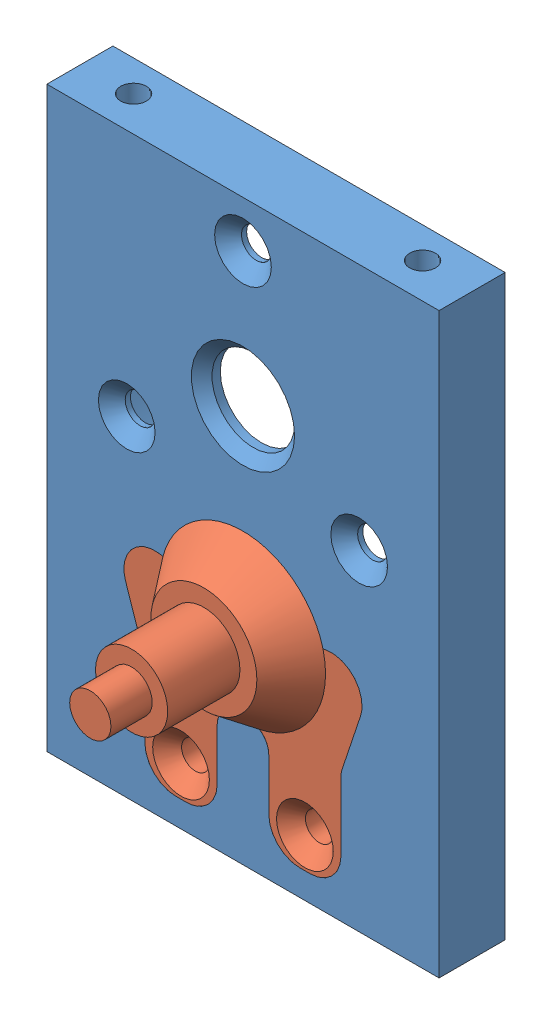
SolidWorks assembly montagem suporte motor.SLDASM, configuration Valor predeterminado (file format 11000). Lengths in mm.
Overall size (38 56 21.19).
2 component instances, 2 part files, 3 mates.
Components (placement in the parent):
- NOVO SUPORTE-1: NOVO SUPORTE.SLDPRT [Valor predeterminado] at (9.7751 -21.7099 52.8) size (38 56 6.52)
- Encaixe suporte-1: Encaixe suporte.SLDPRT [Valor predeterminado] at (9.7751 -1.7099 59.2) x (-1 0 0) z (0 0 -1) size (23.07 25.5 17.99)
Mates (geometry in assembly coordinates):
- Coincidente1: coincident: plane of NOVO SUPORTE-1 through (1.2394 -2.616 56) normal (0 0 1); plane of Encaixe suporte-1 through (1.2394 -2.616 56) normal (0 0 -1)
- Coincidente3: coincident: line of NOVO SUPORTE-1 through (12.2751 -16.2099 59.2) axis (0 1 0); line of Encaixe suporte-1 through (12.2751 -16.2099 59.2) axis (0 1 0)
- Coincidente4: coincident: line of NOVO SUPORTE-1 through (16.2751 -19.2099 59.2) axis (-1 0 0); plane of Encaixe suporte-1 through (15.2751 -19.2099 56) normal (0 -1 0)
